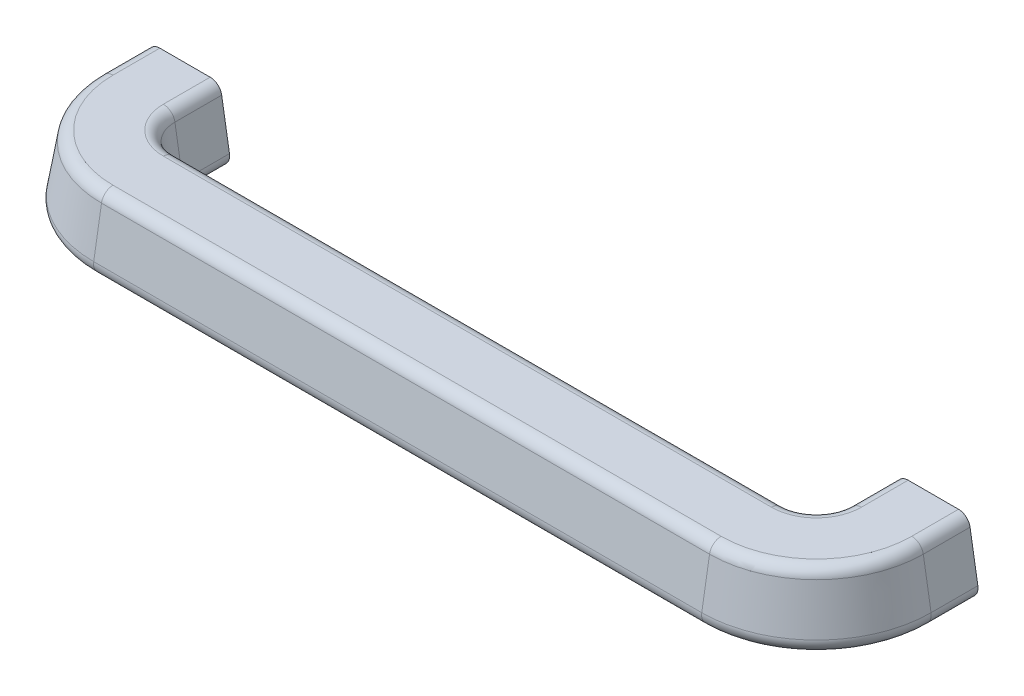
from build123d import *

# Parameters (mm, degrees)
SKETCH2_W = 25.4
SKETCH2_H = 25.4


with BuildPart() as part:
    # Sweep1: sweep along a path in Sketch1
    with BuildLine(Plane(origin=(0, 0, 0), x_dir=(1, 0, 0), z_dir=(0, 1, 0))) as sweep1_path:
        Line((-203.2, 63.5), (-203.2, 38.1))
        ThreePointArc((-203.2, 38.1), (-192.040768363, 11.159231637), (-165.1, 0))
        Line((-165.1, 0), (165.1, 0))
        ThreePointArc((165.1, 0), (192.040768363, 11.159231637), (203.2, 38.1))
        Line((203.2, 38.1), (203.2, 63.5))
    # Sketch2 → Sweep1 (sweep)
    with BuildSketch(Plane(origin=(203.2, 0, -63.5), x_dir=(-1, 0, 0), z_dir=(0, 0, -1))):
        with BuildLine():
            Line((-13.670742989, 19.05), (13.670742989, 19.05))
            ThreePointArc((13.670742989, 19.05), (17.775223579, 17.545176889), (19.934344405, 13.743933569))
            Line((19.934344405, 13.743933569), (24.167677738, -11.656066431))
            ThreePointArc((24.167677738, -11.656066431), (22.749253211, -16.80448059), (17.904076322, -19.05))
            Line((17.904076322, -19.05), (-17.904076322, -19.05))
            ThreePointArc((-17.904076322, -19.05), (-22.749253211, -16.80448059), (-24.167677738, -11.656066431))
            Line((-24.167677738, -11.656066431), (-19.934344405, 13.743933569))
            ThreePointArc((-19.934344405, 13.743933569), (-17.775223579, 17.545176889), (-13.670742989, 19.05))
        make_face()
        Rectangle(SKETCH2_W, SKETCH2_H, mode=Mode.SUBTRACT)
    sweep(path=sweep1_path.line)


solid = part.part
